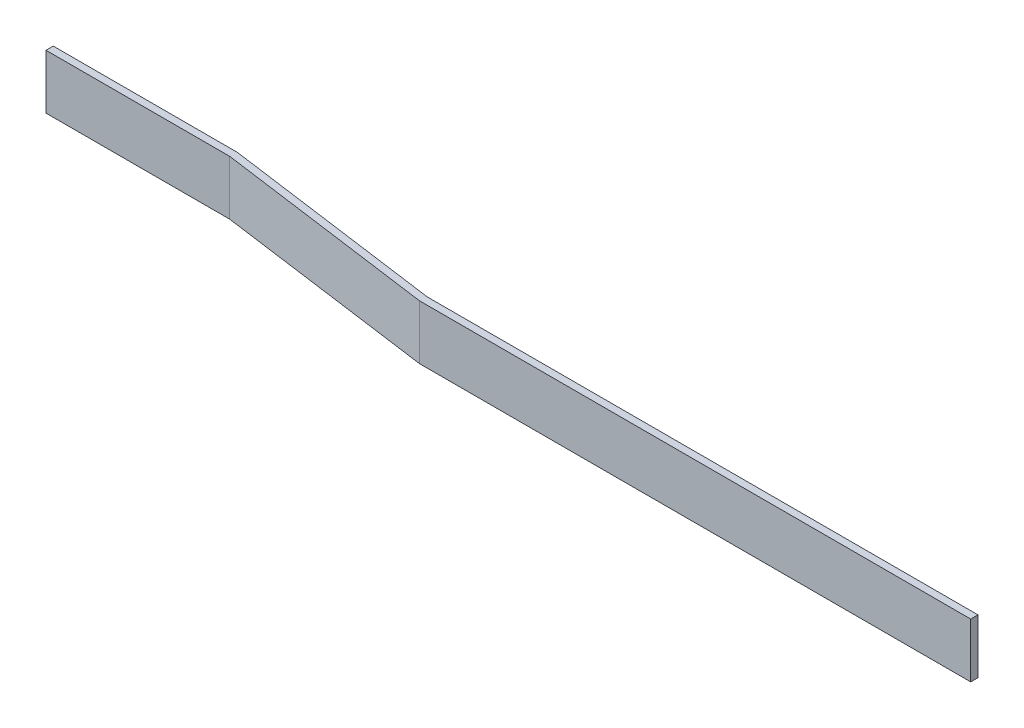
from build123d import *

# Parameters (mm, degrees)
LINEAR_AUSTRAGEN_D_NN1_DEPTH = 15


with BuildPart() as part:
    # Skizze1 → Linear-Austragen-D_nn1 (new body)
    with BuildSketch(Plane(origin=(0, 0, 0), x_dir=(1, 0, 0), z_dir=(0, 1, 0))):
        Polygon((-73.646174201, 11.312050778), (-23.035119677, 11.312050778), (37.529423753, 2.991069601), (189.402795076, 2.991069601), (189.402795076, 4.991069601), (37.66617176, 4.991069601), (-22.898371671, 13.312050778), (-73.646174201, 13.312050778), align=None)
    extrude(amount=LINEAR_AUSTRAGEN_D_NN1_DEPTH)


solid = part.part
